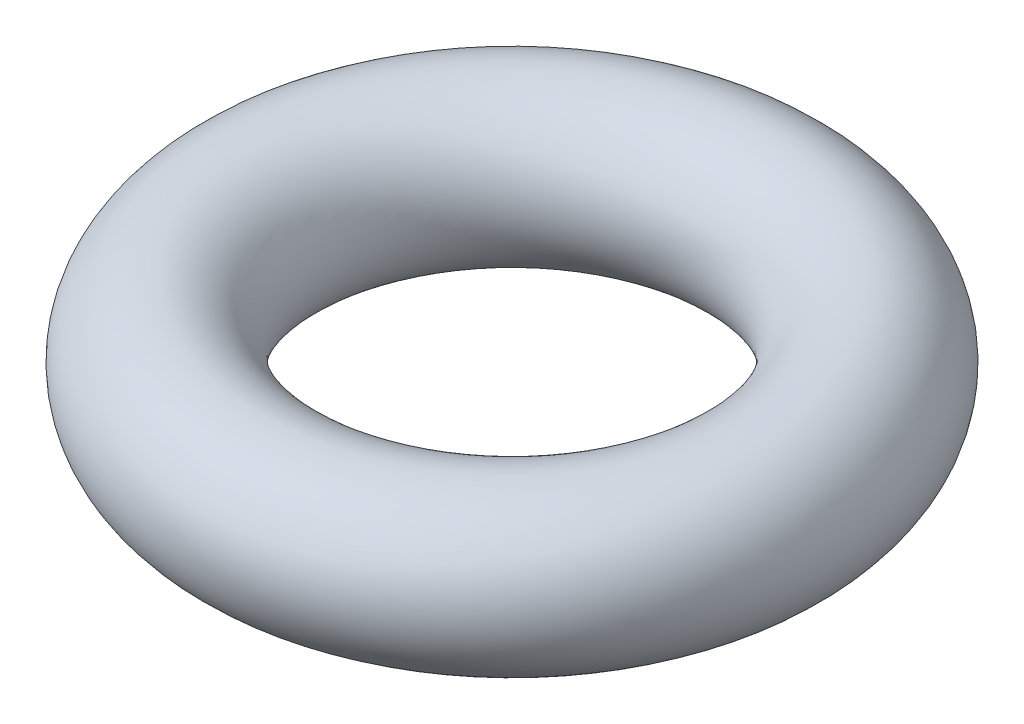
from build123d import *

# Parameters (mm, degrees)
ESQUISSE1_R = 0.95


with BuildPart() as part:
    # Esquisse1 → R_volution1 (revolve)
    with BuildSketch(Plane.XY, mode=Mode.PRIVATE) as r_volution1_sk:
        with Locations((3.05, 0.95)):
            Circle(ESQUISSE1_R)
    revolve(r_volution1_sk.sketch.rotate(Axis((0, 0, 0), (0, 1, 0)), 90), axis=Axis((0, 0, 0), (0, 1, 0)))


solid = part.part
